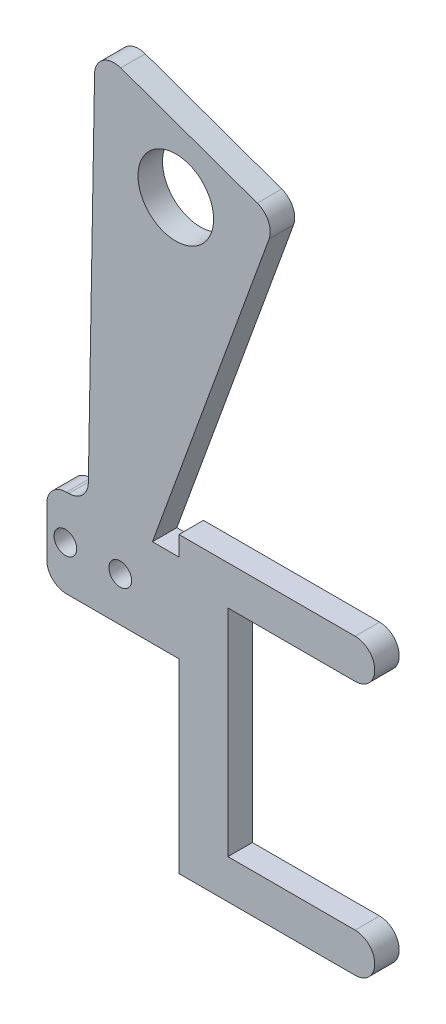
ISO-10303-21;
HEADER;
FILE_DESCRIPTION(('STEP AP214'),'2;1');
FILE_NAME('part.step','',(''),(''),'','','');
FILE_SCHEMA(('AUTOMOTIVE_DESIGN { 1 0 10303 214 1 1 1 1 }'));
ENDSEC;
DATA;
#1=APPLICATION_CONTEXT('core data for automotive mechanical design processes');
#2=APPLICATION_PROTOCOL_DEFINITION('international standard','automotive_design',2000,#1);
#3=PRODUCT_CONTEXT('',#1,'mechanical');
#4=PRODUCT('Part','Part','',(#3));
#5=PRODUCT_RELATED_PRODUCT_CATEGORY('part','',(#4));
#6=PRODUCT_DEFINITION_FORMATION('','',#4);
#7=PRODUCT_DEFINITION_CONTEXT('part definition',#1,'design');
#8=PRODUCT_DEFINITION('design','',#6,#7);
#9=PRODUCT_DEFINITION_SHAPE('','',#8);
#10=(LENGTH_UNIT() NAMED_UNIT(*) SI_UNIT(.MILLI.,.METRE.));
#11=(NAMED_UNIT(*) PLANE_ANGLE_UNIT() SI_UNIT($,.RADIAN.));
#12=(NAMED_UNIT(*) SI_UNIT($,.STERADIAN.) SOLID_ANGLE_UNIT());
#13=UNCERTAINTY_MEASURE_WITH_UNIT(LENGTH_MEASURE(1.E-05),#10,'distance_accuracy_value','');
#14=(GEOMETRIC_REPRESENTATION_CONTEXT(3) GLOBAL_UNCERTAINTY_ASSIGNED_CONTEXT((#13)) GLOBAL_UNIT_ASSIGNED_CONTEXT((#10,
#11,#12)) REPRESENTATION_CONTEXT('',''));
#15=CARTESIAN_POINT('',(0.,0.,0.));
#16=DIRECTION('',(0.,0.,1.));
#17=DIRECTION('',(1.,0.,0.));
#18=AXIS2_PLACEMENT_3D('',#15,#16,#17);
#19=CARTESIAN_POINT('',(0.,11.43,3.175));
#20=DIRECTION('',(0.,-1.,0.));
#21=DIRECTION('',(0.,0.,-1.));
#22=AXIS2_PLACEMENT_3D('',#19,#20,#21);
#23=PLANE('',#22);
#24=DIRECTION('',(-1.,0.,0.));
#25=VECTOR('',#24,1.);
#26=CARTESIAN_POINT('',(0.,11.43,3.175));
#27=LINE('',#26,#25);
#28=CARTESIAN_POINT('',(-0.323217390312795,11.43,3.175));
#29=VERTEX_POINT('',#28);
#30=CARTESIAN_POINT('',(-0.635000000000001,11.43,3.175));
#31=VERTEX_POINT('',#30);
#32=EDGE_CURVE('E189',#29,#31,#27,.T.);
#33=ORIENTED_EDGE('',*,*,#32,.F.);
#34=DIRECTION('',(0.,0.,-1.));
#35=VECTOR('',#34,1.);
#36=CARTESIAN_POINT('',(-0.323217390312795,11.43,0.));
#37=LINE('',#36,#35);
#38=CARTESIAN_POINT('',(-0.323217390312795,11.43,0.));
#39=VERTEX_POINT('',#38);
#40=EDGE_CURVE('E249',#29,#39,#37,.T.);
#41=ORIENTED_EDGE('',*,*,#40,.T.);
#42=DIRECTION('',(-1.,0.,0.));
#43=VECTOR('',#42,1.);
#44=CARTESIAN_POINT('',(0.,11.43,0.));
#45=LINE('',#44,#43);
#46=CARTESIAN_POINT('',(-0.635000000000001,11.43,0.));
#47=VERTEX_POINT('',#46);
#48=EDGE_CURVE('E255',#39,#47,#45,.T.);
#49=ORIENTED_EDGE('',*,*,#48,.T.);
#50=DIRECTION('',(0.,0.,-1.));
#51=VECTOR('',#50,1.);
#52=CARTESIAN_POINT('',(-0.635000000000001,11.43,3.175));
#53=LINE('',#52,#51);
#54=EDGE_CURVE('E225',#47,#31,#53,.F.);
#55=ORIENTED_EDGE('',*,*,#54,.T.);
#56=EDGE_LOOP('',(#33,#41,#49,#55));
#57=FACE_BOUND('',#56,.T.);
#58=ADVANCED_FACE('F34',(#57),#23,.F.);
#59=DIRECTION('',(0.,0.,-1.));
#60=VECTOR('',#59,1.);
#61=CARTESIAN_POINT('',(10.5271663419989,11.43,3.175));
#62=LINE('',#61,#60);
#63=CARTESIAN_POINT('',(10.5271663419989,11.43,3.175));
#64=VERTEX_POINT('',#63);
#65=CARTESIAN_POINT('',(10.5271663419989,11.43,0.));
#66=VERTEX_POINT('',#65);
#67=EDGE_CURVE('E184',#64,#66,#62,.T.);
#68=ORIENTED_EDGE('',*,*,#67,.F.);
#69=CARTESIAN_POINT('',(13.97,11.43,3.175));
#70=VERTEX_POINT('',#69);
#71=EDGE_CURVE('E177',#70,#64,#27,.T.);
#72=ORIENTED_EDGE('',*,*,#71,.F.);
#73=DIRECTION('',(0.,0.,-1.));
#74=VECTOR('',#73,1.);
#75=CARTESIAN_POINT('',(13.97,11.43,3.175));
#76=LINE('',#75,#74);
#77=CARTESIAN_POINT('',(13.97,11.43,0.));
#78=VERTEX_POINT('',#77);
#79=EDGE_CURVE('E181',#70,#78,#76,.T.);
#80=ORIENTED_EDGE('',*,*,#79,.T.);
#81=EDGE_CURVE('E261',#78,#66,#45,.T.);
#82=ORIENTED_EDGE('',*,*,#81,.T.);
#83=EDGE_LOOP('',(#68,#72,#80,#82));
#84=FACE_BOUND('',#83,.T.);
#85=ADVANCED_FACE('F179',(#84),#23,.F.);
#86=CARTESIAN_POINT('',(13.97,11.43,3.175));
#87=DIRECTION('',(1.,0.,0.));
#88=DIRECTION('',(0.,0.,-1.));
#89=AXIS2_PLACEMENT_3D('',#86,#87,#88);
#90=PLANE('',#89);
#91=DIRECTION('',(0.,-1.,0.));
#92=VECTOR('',#91,1.);
#93=CARTESIAN_POINT('',(13.97,11.43,0.));
#94=LINE('',#93,#92);
#95=CARTESIAN_POINT('',(13.97,13.97,0.));
#96=VERTEX_POINT('',#95);
#97=EDGE_CURVE('E203',#96,#78,#94,.T.);
#98=ORIENTED_EDGE('',*,*,#97,.T.);
#99=ORIENTED_EDGE('',*,*,#79,.F.);
#100=DIRECTION('',(0.,-1.,0.));
#101=VECTOR('',#100,1.);
#102=CARTESIAN_POINT('',(13.97,11.43,3.175));
#103=LINE('',#102,#101);
#104=CARTESIAN_POINT('',(13.97,13.97,3.175));
#105=VERTEX_POINT('',#104);
#106=EDGE_CURVE('E192',#105,#70,#103,.T.);
#107=ORIENTED_EDGE('',*,*,#106,.F.);
#108=DIRECTION('',(0.,0.,-1.));
#109=VECTOR('',#108,1.);
#110=CARTESIAN_POINT('',(13.97,13.97,3.175));
#111=LINE('',#110,#109);
#112=EDGE_CURVE('E283',#105,#96,#111,.T.);
#113=ORIENTED_EDGE('',*,*,#112,.T.);
#114=EDGE_LOOP('',(#98,#99,#107,#113));
#115=FACE_BOUND('',#114,.T.);
#116=ADVANCED_FACE('F201',(#115),#90,.F.);
#117=CARTESIAN_POINT('',(13.97,0.,3.175));
#118=DIRECTION('',(0.,1.,0.));
#119=DIRECTION('',(-1.,0.,0.));
#120=AXIS2_PLACEMENT_3D('',#117,#118,#119);
#121=PLANE('',#120);
#122=DIRECTION('',(1.,0.,0.));
#123=VECTOR('',#122,1.);
#124=CARTESIAN_POINT('',(13.97,0.,3.175));
#125=LINE('',#124,#123);
#126=CARTESIAN_POINT('',(-0.635,0.,3.175));
#127=VERTEX_POINT('',#126);
#128=CARTESIAN_POINT('',(13.97,0.,3.175));
#129=VERTEX_POINT('',#128);
#130=EDGE_CURVE('E188',#127,#129,#125,.T.);
#131=ORIENTED_EDGE('',*,*,#130,.F.);
#132=DIRECTION('',(0.,0.,-1.));
#133=VECTOR('',#132,1.);
#134=CARTESIAN_POINT('',(-0.635,0.,3.175));
#135=LINE('',#134,#133);
#136=CARTESIAN_POINT('',(-0.635,0.,0.));
#137=VERTEX_POINT('',#136);
#138=EDGE_CURVE('E246',#127,#137,#135,.T.);
#139=ORIENTED_EDGE('',*,*,#138,.T.);
#140=DIRECTION('',(1.,0.,0.));
#141=VECTOR('',#140,1.);
#142=CARTESIAN_POINT('',(13.97,0.,0.));
#143=LINE('',#142,#141);
#144=CARTESIAN_POINT('',(13.97,0.,0.));
#145=VERTEX_POINT('',#144);
#146=EDGE_CURVE('E263',#137,#145,#143,.T.);
#147=ORIENTED_EDGE('',*,*,#146,.T.);
#148=DIRECTION('',(0.,0.,-1.));
#149=VECTOR('',#148,1.);
#150=CARTESIAN_POINT('',(13.97,0.,3.175));
#151=LINE('',#150,#149);
#152=EDGE_CURVE('E205',#129,#145,#151,.T.);
#153=ORIENTED_EDGE('',*,*,#152,.F.);
#154=EDGE_LOOP('',(#131,#139,#147,#153));
#155=FACE_BOUND('',#154,.T.);
#156=ADVANCED_FACE('F368',(#155),#121,.F.);
#157=CARTESIAN_POINT('',(13.97,-24.13,3.175));
#158=DIRECTION('',(1.,0.,0.));
#159=DIRECTION('',(0.,0.,-1.));
#160=AXIS2_PLACEMENT_3D('',#157,#158,#159);
#161=PLANE('',#160);
#162=DIRECTION('',(0.,-1.,0.));
#163=VECTOR('',#162,1.);
#164=CARTESIAN_POINT('',(13.97,-24.13,0.));
#165=LINE('',#164,#163);
#166=CARTESIAN_POINT('',(13.97,-24.13,0.));
#167=VERTEX_POINT('',#166);
#168=EDGE_CURVE('E268',#145,#167,#165,.T.);
#169=ORIENTED_EDGE('',*,*,#168,.T.);
#170=DIRECTION('',(0.,0.,-1.));
#171=VECTOR('',#170,1.);
#172=CARTESIAN_POINT('',(13.97,-24.13,3.175));
#173=LINE('',#172,#171);
#174=CARTESIAN_POINT('',(13.97,-24.13,3.175));
#175=VERTEX_POINT('',#174);
#176=EDGE_CURVE('E210',#175,#167,#173,.T.);
#177=ORIENTED_EDGE('',*,*,#176,.F.);
#178=DIRECTION('',(0.,-1.,0.));
#179=VECTOR('',#178,1.);
#180=CARTESIAN_POINT('',(13.97,-24.13,3.175));
#181=LINE('',#180,#179);
#182=EDGE_CURVE('E363',#129,#175,#181,.T.);
#183=ORIENTED_EDGE('',*,*,#182,.F.);
#184=ORIENTED_EDGE('',*,*,#152,.T.);
#185=EDGE_LOOP('',(#169,#177,#183,#184));
#186=FACE_BOUND('',#185,.T.);
#187=ADVANCED_FACE('F366',(#186),#161,.F.);
#188=CARTESIAN_POINT('',(13.97,-24.13,3.175));
#189=DIRECTION('',(0.,1.,0.));
#190=DIRECTION('',(0.,0.,1.));
#191=AXIS2_PLACEMENT_3D('',#188,#189,#190);
#192=PLANE('',#191);
#193=DIRECTION('',(1.,0.,0.));
#194=VECTOR('',#193,1.);
#195=CARTESIAN_POINT('',(13.97,-24.13,0.));
#196=LINE('',#195,#194);
#197=CARTESIAN_POINT('',(36.83,-24.13,0.));
#198=VERTEX_POINT('',#197);
#199=EDGE_CURVE('E270',#167,#198,#196,.T.);
#200=ORIENTED_EDGE('',*,*,#199,.T.);
#201=DIRECTION('',(0.,0.,-1.));
#202=VECTOR('',#201,1.);
#203=CARTESIAN_POINT('',(36.83,-24.13,3.175));
#204=LINE('',#203,#202);
#205=CARTESIAN_POINT('',(36.83,-24.13,3.175));
#206=VERTEX_POINT('',#205);
#207=EDGE_CURVE('E300',#206,#198,#204,.T.);
#208=ORIENTED_EDGE('',*,*,#207,.F.);
#209=DIRECTION('',(1.,0.,0.));
#210=VECTOR('',#209,1.);
#211=CARTESIAN_POINT('',(13.97,-24.13,3.175));
#212=LINE('',#211,#210);
#213=EDGE_CURVE('E309',#175,#206,#212,.T.);
#214=ORIENTED_EDGE('',*,*,#213,.F.);
#215=ORIENTED_EDGE('',*,*,#176,.T.);
#216=EDGE_LOOP('',(#200,#208,#214,#215));
#217=FACE_BOUND('',#216,.T.);
#218=ADVANCED_FACE('F307',(#217),#192,.F.);
#219=CARTESIAN_POINT('',(36.83,-21.59,3.175));
#220=DIRECTION('',(0.,0.,-1.));
#221=DIRECTION('',(-1.,0.,0.));
#222=AXIS2_PLACEMENT_3D('',#219,#220,#221);
#223=CYLINDRICAL_SURFACE('',#222,2.54);
#224=CARTESIAN_POINT('',(36.83,-21.59,0.));
#225=DIRECTION('',(0.,0.,1.));
#226=DIRECTION('',(-1.,0.,0.));
#227=AXIS2_PLACEMENT_3D('',#224,#225,#226);
#228=CIRCLE('',#227,2.54);
#229=CARTESIAN_POINT('',(36.83,-19.05,0.));
#230=VERTEX_POINT('',#229);
#231=EDGE_CURVE('E272',#198,#230,#228,.T.);
#232=ORIENTED_EDGE('',*,*,#231,.T.);
#233=DIRECTION('',(0.,0.,-1.));
#234=VECTOR('',#233,1.);
#235=CARTESIAN_POINT('',(36.83,-19.05,3.175));
#236=LINE('',#235,#234);
#237=CARTESIAN_POINT('',(36.83,-19.05,3.175));
#238=VERTEX_POINT('',#237);
#239=EDGE_CURVE('E297',#238,#230,#236,.T.);
#240=ORIENTED_EDGE('',*,*,#239,.F.);
#241=CARTESIAN_POINT('',(36.83,-21.59,3.175));
#242=DIRECTION('',(0.,0.,1.));
#243=DIRECTION('',(-1.,0.,0.));
#244=AXIS2_PLACEMENT_3D('',#241,#242,#243);
#245=CIRCLE('',#244,2.54);
#246=EDGE_CURVE('E328',#206,#238,#245,.T.);
#247=ORIENTED_EDGE('',*,*,#246,.F.);
#248=ORIENTED_EDGE('',*,*,#207,.T.);
#249=EDGE_LOOP('',(#232,#240,#247,#248));
#250=FACE_BOUND('',#249,.T.);
#251=ADVANCED_FACE('F319',(#250),#223,.T.);
#252=CARTESIAN_POINT('',(20.32,-19.05,3.175));
#253=DIRECTION('',(0.,-1.,0.));
#254=DIRECTION('',(0.,0.,-1.));
#255=AXIS2_PLACEMENT_3D('',#252,#253,#254);
#256=PLANE('',#255);
#257=DIRECTION('',(-1.,0.,0.));
#258=VECTOR('',#257,1.);
#259=CARTESIAN_POINT('',(20.32,-19.05,0.));
#260=LINE('',#259,#258);
#261=CARTESIAN_POINT('',(20.32,-19.05,0.));
#262=VERTEX_POINT('',#261);
#263=EDGE_CURVE('E274',#230,#262,#260,.T.);
#264=ORIENTED_EDGE('',*,*,#263,.T.);
#265=DIRECTION('',(0.,0.,-1.));
#266=VECTOR('',#265,1.);
#267=CARTESIAN_POINT('',(20.32,-19.05,3.175));
#268=LINE('',#267,#266);
#269=CARTESIAN_POINT('',(20.32,-19.05,3.175));
#270=VERTEX_POINT('',#269);
#271=EDGE_CURVE('E294',#270,#262,#268,.T.);
#272=ORIENTED_EDGE('',*,*,#271,.F.);
#273=DIRECTION('',(-1.,0.,0.));
#274=VECTOR('',#273,1.);
#275=CARTESIAN_POINT('',(20.32,-19.05,3.175));
#276=LINE('',#275,#274);
#277=EDGE_CURVE('E325',#238,#270,#276,.T.);
#278=ORIENTED_EDGE('',*,*,#277,.F.);
#279=ORIENTED_EDGE('',*,*,#239,.T.);
#280=EDGE_LOOP('',(#264,#272,#278,#279));
#281=FACE_BOUND('',#280,.T.);
#282=ADVANCED_FACE('F323',(#281),#256,.F.);
#283=CARTESIAN_POINT('',(20.32,8.89,3.175));
#284=DIRECTION('',(-1.,0.,0.));
#285=DIRECTION('',(0.,-1.,0.));
#286=AXIS2_PLACEMENT_3D('',#283,#284,#285);
#287=PLANE('',#286);
#288=DIRECTION('',(0.,1.,0.));
#289=VECTOR('',#288,1.);
#290=CARTESIAN_POINT('',(20.32,8.89,0.));
#291=LINE('',#290,#289);
#292=CARTESIAN_POINT('',(20.32,8.89,0.));
#293=VERTEX_POINT('',#292);
#294=EDGE_CURVE('E276',#262,#293,#291,.T.);
#295=ORIENTED_EDGE('',*,*,#294,.T.);
#296=DIRECTION('',(0.,0.,-1.));
#297=VECTOR('',#296,1.);
#298=CARTESIAN_POINT('',(20.32,8.89,3.175));
#299=LINE('',#298,#297);
#300=CARTESIAN_POINT('',(20.32,8.89,3.175));
#301=VERTEX_POINT('',#300);
#302=EDGE_CURVE('E291',#301,#293,#299,.T.);
#303=ORIENTED_EDGE('',*,*,#302,.F.);
#304=DIRECTION('',(0.,1.,0.));
#305=VECTOR('',#304,1.);
#306=CARTESIAN_POINT('',(20.32,8.89,3.175));
#307=LINE('',#306,#305);
#308=EDGE_CURVE('E327',#270,#301,#307,.T.);
#309=ORIENTED_EDGE('',*,*,#308,.F.);
#310=ORIENTED_EDGE('',*,*,#271,.T.);
#311=EDGE_LOOP('',(#295,#303,#309,#310));
#312=FACE_BOUND('',#311,.T.);
#313=ADVANCED_FACE('F444',(#312),#287,.F.);
#314=CARTESIAN_POINT('',(20.32,8.89,3.175));
#315=DIRECTION('',(0.,1.,0.));
#316=DIRECTION('',(0.,0.,1.));
#317=AXIS2_PLACEMENT_3D('',#314,#315,#316);
#318=PLANE('',#317);
#319=DIRECTION('',(1.,0.,0.));
#320=VECTOR('',#319,1.);
#321=CARTESIAN_POINT('',(20.32,8.89,0.));
#322=LINE('',#321,#320);
#323=CARTESIAN_POINT('',(36.83,8.89,0.));
#324=VERTEX_POINT('',#323);
#325=EDGE_CURVE('E278',#293,#324,#322,.T.);
#326=ORIENTED_EDGE('',*,*,#325,.T.);
#327=DIRECTION('',(0.,0.,-1.));
#328=VECTOR('',#327,1.);
#329=CARTESIAN_POINT('',(36.83,8.89,3.175));
#330=LINE('',#329,#328);
#331=CARTESIAN_POINT('',(36.83,8.89,3.175));
#332=VERTEX_POINT('',#331);
#333=EDGE_CURVE('E288',#332,#324,#330,.T.);
#334=ORIENTED_EDGE('',*,*,#333,.F.);
#335=DIRECTION('',(1.,0.,0.));
#336=VECTOR('',#335,1.);
#337=CARTESIAN_POINT('',(20.32,8.89,3.175));
#338=LINE('',#337,#336);
#339=EDGE_CURVE('E330',#301,#332,#338,.T.);
#340=ORIENTED_EDGE('',*,*,#339,.F.);
#341=ORIENTED_EDGE('',*,*,#302,.T.);
#342=EDGE_LOOP('',(#326,#334,#340,#341));
#343=FACE_BOUND('',#342,.T.);
#344=ADVANCED_FACE('F447',(#343),#318,.F.);
#345=CARTESIAN_POINT('',(36.83,11.43,3.175));
#346=DIRECTION('',(0.,0.,-1.));
#347=DIRECTION('',(-1.,0.,0.));
#348=AXIS2_PLACEMENT_3D('',#345,#346,#347);
#349=CYLINDRICAL_SURFACE('',#348,2.54);
#350=CARTESIAN_POINT('',(36.83,11.43,0.));
#351=DIRECTION('',(0.,0.,1.));
#352=DIRECTION('',(1.,0.,0.));
#353=AXIS2_PLACEMENT_3D('',#350,#351,#352);
#354=CIRCLE('',#353,2.54);
#355=CARTESIAN_POINT('',(36.83,13.97,0.));
#356=VERTEX_POINT('',#355);
#357=EDGE_CURVE('E280',#324,#356,#354,.T.);
#358=ORIENTED_EDGE('',*,*,#357,.T.);
#359=DIRECTION('',(0.,0.,-1.));
#360=VECTOR('',#359,1.);
#361=CARTESIAN_POINT('',(36.83,13.97,3.175));
#362=LINE('',#361,#360);
#363=CARTESIAN_POINT('',(36.83,13.97,3.175));
#364=VERTEX_POINT('',#363);
#365=EDGE_CURVE('E285',#364,#356,#362,.T.);
#366=ORIENTED_EDGE('',*,*,#365,.F.);
#367=CARTESIAN_POINT('',(36.83,11.43,3.175));
#368=DIRECTION('',(0.,0.,1.));
#369=DIRECTION('',(1.,0.,0.));
#370=AXIS2_PLACEMENT_3D('',#367,#368,#369);
#371=CIRCLE('',#370,2.54);
#372=EDGE_CURVE('E336',#332,#364,#371,.T.);
#373=ORIENTED_EDGE('',*,*,#372,.F.);
#374=ORIENTED_EDGE('',*,*,#333,.T.);
#375=EDGE_LOOP('',(#358,#366,#373,#374));
#376=FACE_BOUND('',#375,.T.);
#377=ADVANCED_FACE('F342',(#376),#349,.T.);
#378=CARTESIAN_POINT('',(36.83,13.97,3.175));
#379=DIRECTION('',(0.,-1.,0.));
#380=DIRECTION('',(1.,0.,0.));
#381=AXIS2_PLACEMENT_3D('',#378,#379,#380);
#382=PLANE('',#381);
#383=DIRECTION('',(-1.,0.,0.));
#384=VECTOR('',#383,1.);
#385=CARTESIAN_POINT('',(36.83,13.97,0.));
#386=LINE('',#385,#384);
#387=EDGE_CURVE('E199',#356,#96,#386,.T.);
#388=ORIENTED_EDGE('',*,*,#387,.T.);
#389=ORIENTED_EDGE('',*,*,#112,.F.);
#390=DIRECTION('',(-1.,0.,0.));
#391=VECTOR('',#390,1.);
#392=CARTESIAN_POINT('',(36.83,13.97,3.175));
#393=LINE('',#392,#391);
#394=EDGE_CURVE('E195',#364,#105,#393,.T.);
#395=ORIENTED_EDGE('',*,*,#394,.F.);
#396=ORIENTED_EDGE('',*,*,#365,.T.);
#397=EDGE_LOOP('',(#388,#389,#395,#396));
#398=FACE_BOUND('',#397,.T.);
#399=ADVANCED_FACE('F346',(#398),#382,.F.);
#400=CARTESIAN_POINT('',(36.83,11.43,3.175));
#401=DIRECTION('',(0.,0.,1.));
#402=DIRECTION('',(1.,0.,0.));
#403=AXIS2_PLACEMENT_3D('',#400,#401,#402);
#404=PLANE('',#403);
#405=CARTESIAN_POINT('',(13.5585725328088,51.6272762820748,3.175));
#406=DIRECTION('',(0.,0.,1.));
#407=DIRECTION('',(1.,0.,0.));
#408=AXIS2_PLACEMENT_3D('',#405,#406,#407);
#409=CIRCLE('',#408,4.90219999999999);
#410=CARTESIAN_POINT('',(18.4607725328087,51.6272762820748,3.175));
#411=VERTEX_POINT('',#410);
#412=EDGE_CURVE('E491',#411,#411,#409,.T.);
#413=ORIENTED_EDGE('',*,*,#412,.F.);
#414=EDGE_LOOP('',(#413));
#415=FACE_BOUND('',#414,.T.);
#416=CARTESIAN_POINT('',(-0.762000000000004,5.715,3.175));
#417=DIRECTION('',(0.,0.,1.));
#418=DIRECTION('',(1.,0.,0.));
#419=AXIS2_PLACEMENT_3D('',#416,#417,#418);
#420=CIRCLE('',#419,1.47319999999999);
#421=CARTESIAN_POINT('',(0.711199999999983,5.715,3.175));
#422=VERTEX_POINT('',#421);
#423=EDGE_CURVE('E484',#422,#422,#420,.T.);
#424=ORIENTED_EDGE('',*,*,#423,.F.);
#425=EDGE_LOOP('',(#424));
#426=FACE_BOUND('',#425,.T.);
#427=CARTESIAN_POINT('',(6.35,5.715,3.175));
#428=DIRECTION('',(0.,0.,1.));
#429=DIRECTION('',(1.,0.,0.));
#430=AXIS2_PLACEMENT_3D('',#427,#428,#429);
#431=CIRCLE('',#430,1.47319999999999);
#432=CARTESIAN_POINT('',(7.82319999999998,5.715,3.175));
#433=VERTEX_POINT('',#432);
#434=EDGE_CURVE('E488',#433,#433,#431,.T.);
#435=ORIENTED_EDGE('',*,*,#434,.F.);
#436=EDGE_LOOP('',(#435));
#437=FACE_BOUND('',#436,.T.);
#438=DIRECTION('',(-0.0174524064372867,-0.999847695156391,0.));
#439=VECTOR('',#438,1.);
#440=CARTESIAN_POINT('',(2.17283365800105,11.43,3.175));
#441=LINE('',#440,#439);
#442=CARTESIAN_POINT('',(3.02521909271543,60.2631288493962,3.175));
#443=VERTEX_POINT('',#442);
#444=CARTESIAN_POINT('',(2.21639575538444,13.9256708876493,3.175));
#445=VERTEX_POINT('',#444);
#446=EDGE_CURVE('E391',#443,#445,#441,.T.);
#447=ORIENTED_EDGE('',*,*,#446,.T.);
#448=CARTESIAN_POINT('',(-0.323217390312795,13.97,3.175));
#449=DIRECTION('',(0.,0.,1.));
#450=DIRECTION('',(1.,0.,0.));
#451=AXIS2_PLACEMENT_3D('',#448,#449,#450);
#452=CIRCLE('',#451,2.54);
#453=EDGE_CURVE('E11',#445,#29,#452,.F.);
#454=ORIENTED_EDGE('',*,*,#453,.T.);
#455=ORIENTED_EDGE('',*,*,#32,.T.);
#456=CARTESIAN_POINT('',(-0.635000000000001,8.89,3.175));
#457=DIRECTION('',(0.,0.,1.));
#458=DIRECTION('',(1.,0.,0.));
#459=AXIS2_PLACEMENT_3D('',#456,#457,#458);
#460=CIRCLE('',#459,2.54);
#461=CARTESIAN_POINT('',(-3.175,8.89,3.175));
#462=VERTEX_POINT('',#461);
#463=EDGE_CURVE('E234',#31,#462,#460,.T.);
#464=ORIENTED_EDGE('',*,*,#463,.T.);
#465=DIRECTION('',(0.,-1.,0.));
#466=VECTOR('',#465,1.);
#467=CARTESIAN_POINT('',(-3.175,11.43,3.175));
#468=LINE('',#467,#466);
#469=CARTESIAN_POINT('',(-3.175,2.54,3.175));
#470=VERTEX_POINT('',#469);
#471=EDGE_CURVE('E379',#462,#470,#468,.T.);
#472=ORIENTED_EDGE('',*,*,#471,.T.);
#473=CARTESIAN_POINT('',(-0.635,2.54,3.175));
#474=DIRECTION('',(0.,0.,1.));
#475=DIRECTION('',(1.,0.,0.));
#476=AXIS2_PLACEMENT_3D('',#473,#474,#475);
#477=CIRCLE('',#476,2.54);
#478=EDGE_CURVE('E228',#470,#127,#477,.T.);
#479=ORIENTED_EDGE('',*,*,#478,.T.);
#480=ORIENTED_EDGE('',*,*,#130,.T.);
#481=ORIENTED_EDGE('',*,*,#182,.T.);
#482=ORIENTED_EDGE('',*,*,#213,.T.);
#483=ORIENTED_EDGE('',*,*,#246,.T.);
#484=ORIENTED_EDGE('',*,*,#277,.T.);
#485=ORIENTED_EDGE('',*,*,#308,.T.);
#486=ORIENTED_EDGE('',*,*,#339,.T.);
#487=ORIENTED_EDGE('',*,*,#372,.T.);
#488=ORIENTED_EDGE('',*,*,#394,.T.);
#489=ORIENTED_EDGE('',*,*,#106,.T.);
#490=ORIENTED_EDGE('',*,*,#71,.T.);
#491=DIRECTION('',(0.342020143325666,0.93969262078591,0.));
#492=VECTOR('',#491,1.);
#493=CARTESIAN_POINT('',(10.5271663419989,11.43,3.175));
#494=LINE('',#493,#492);
#495=CARTESIAN_POINT('',(25.6629385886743,53.0151924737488,3.175));
#496=VERTEX_POINT('',#495);
#497=EDGE_CURVE('E353',#64,#496,#494,.T.);
#498=ORIENTED_EDGE('',*,*,#497,.T.);
#499=CARTESIAN_POINT('',(23.276119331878,53.883923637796,3.175));
#500=DIRECTION('',(0.,0.,1.));
#501=DIRECTION('',(1.,0.,0.));
#502=AXIS2_PLACEMENT_3D('',#499,#500,#501);
#503=CIRCLE('',#502,2.54);
#504=CARTESIAN_POINT('',(24.1315413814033,56.2755450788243,3.175));
#505=VERTEX_POINT('',#504);
#506=EDGE_CURVE('E232',#496,#505,#503,.T.);
#507=ORIENTED_EDGE('',*,*,#506,.T.);
#508=DIRECTION('',(-0.941583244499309,0.336780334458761,0.));
#509=VECTOR('',#508,1.);
#510=CARTESIAN_POINT('',(3.0870015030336,63.8026407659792,3.175));
#511=LINE('',#510,#509);
#512=CARTESIAN_POINT('',(6.42025428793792,62.6104211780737,3.175));
#513=VERTEX_POINT('',#512);
#514=EDGE_CURVE('E354',#505,#513,#511,.T.);
#515=ORIENTED_EDGE('',*,*,#514,.T.);
#516=CARTESIAN_POINT('',(5.56483223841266,60.2187997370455,3.175));
#517=DIRECTION('',(0.,0.,1.));
#518=DIRECTION('',(1.,0.,0.));
#519=AXIS2_PLACEMENT_3D('',#516,#517,#518);
#520=CIRCLE('',#519,2.54);
#521=EDGE_CURVE('E230',#513,#443,#520,.T.);
#522=ORIENTED_EDGE('',*,*,#521,.T.);
#523=EDGE_LOOP('',(#447,#454,#455,#464,#472,#479,#480,#481,#482,#483,#484,#485,#486,#487,#488,
#489,#490,#498,#507,#515,#522));
#524=FACE_BOUND('',#523,.T.);
#525=ADVANCED_FACE('F193',(#415,#426,#437,#524),#404,.T.);
#526=CARTESIAN_POINT('',(36.83,11.43,0.));
#527=DIRECTION('',(0.,0.,1.));
#528=DIRECTION('',(1.,0.,0.));
#529=AXIS2_PLACEMENT_3D('',#526,#527,#528);
#530=PLANE('',#529);
#531=CARTESIAN_POINT('',(13.5585725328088,51.6272762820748,0.));
#532=DIRECTION('',(0.,0.,1.));
#533=DIRECTION('',(1.,0.,0.));
#534=AXIS2_PLACEMENT_3D('',#531,#532,#533);
#535=CIRCLE('',#534,4.9022);
#536=CARTESIAN_POINT('',(18.4607725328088,51.6272762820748,0.));
#537=VERTEX_POINT('',#536);
#538=EDGE_CURVE('E486',#537,#537,#535,.T.);
#539=ORIENTED_EDGE('',*,*,#538,.T.);
#540=EDGE_LOOP('',(#539));
#541=FACE_BOUND('',#540,.T.);
#542=CARTESIAN_POINT('',(-0.762000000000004,5.715,0.));
#543=DIRECTION('',(0.,0.,1.));
#544=DIRECTION('',(1.,0.,0.));
#545=AXIS2_PLACEMENT_3D('',#542,#543,#544);
#546=CIRCLE('',#545,1.4732);
#547=CARTESIAN_POINT('',(0.711199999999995,5.715,0.));
#548=VERTEX_POINT('',#547);
#549=EDGE_CURVE('E481',#548,#548,#546,.T.);
#550=ORIENTED_EDGE('',*,*,#549,.T.);
#551=EDGE_LOOP('',(#550));
#552=FACE_BOUND('',#551,.T.);
#553=CARTESIAN_POINT('',(6.35,5.715,0.));
#554=DIRECTION('',(0.,0.,1.));
#555=DIRECTION('',(1.,0.,0.));
#556=AXIS2_PLACEMENT_3D('',#553,#554,#555);
#557=CIRCLE('',#556,1.4732);
#558=CARTESIAN_POINT('',(7.8232,5.715,0.));
#559=VERTEX_POINT('',#558);
#560=EDGE_CURVE('E380',#559,#559,#557,.T.);
#561=ORIENTED_EDGE('',*,*,#560,.T.);
#562=EDGE_LOOP('',(#561));
#563=FACE_BOUND('',#562,.T.);
#564=DIRECTION('',(0.,-1.,0.));
#565=VECTOR('',#564,1.);
#566=CARTESIAN_POINT('',(-3.175,11.43,0.));
#567=LINE('',#566,#565);
#568=CARTESIAN_POINT('',(-3.175,8.89,0.));
#569=VERTEX_POINT('',#568);
#570=CARTESIAN_POINT('',(-3.175,2.54,0.));
#571=VERTEX_POINT('',#570);
#572=EDGE_CURVE('E371',#569,#571,#567,.T.);
#573=ORIENTED_EDGE('',*,*,#572,.F.);
#574=CARTESIAN_POINT('',(-0.635000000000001,8.89,0.));
#575=DIRECTION('',(0.,0.,1.));
#576=DIRECTION('',(1.,0.,0.));
#577=AXIS2_PLACEMENT_3D('',#574,#575,#576);
#578=CIRCLE('',#577,2.54);
#579=EDGE_CURVE('E222',#569,#47,#578,.F.);
#580=ORIENTED_EDGE('',*,*,#579,.T.);
#581=ORIENTED_EDGE('',*,*,#48,.F.);
#582=CARTESIAN_POINT('',(-0.323217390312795,13.97,0.));
#583=DIRECTION('',(0.,0.,1.));
#584=DIRECTION('',(1.,0.,0.));
#585=AXIS2_PLACEMENT_3D('',#582,#583,#584);
#586=CIRCLE('',#585,2.54);
#587=CARTESIAN_POINT('',(2.21639575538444,13.9256708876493,0.));
#588=VERTEX_POINT('',#587);
#589=EDGE_CURVE('E42',#39,#588,#586,.T.);
#590=ORIENTED_EDGE('',*,*,#589,.T.);
#591=DIRECTION('',(-0.0174524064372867,-0.999847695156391,0.));
#592=VECTOR('',#591,1.);
#593=CARTESIAN_POINT('',(2.17283365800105,11.43,0.));
#594=LINE('',#593,#592);
#595=CARTESIAN_POINT('',(3.02521909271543,60.2631288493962,0.));
#596=VERTEX_POINT('',#595);
#597=EDGE_CURVE('E385',#596,#588,#594,.T.);
#598=ORIENTED_EDGE('',*,*,#597,.F.);
#599=CARTESIAN_POINT('',(5.56483223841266,60.2187997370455,0.));
#600=DIRECTION('',(0.,0.,1.));
#601=DIRECTION('',(1.,0.,0.));
#602=AXIS2_PLACEMENT_3D('',#599,#600,#601);
#603=CIRCLE('',#602,2.54);
#604=CARTESIAN_POINT('',(6.42025428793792,62.6104211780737,0.));
#605=VERTEX_POINT('',#604);
#606=EDGE_CURVE('E218',#596,#605,#603,.F.);
#607=ORIENTED_EDGE('',*,*,#606,.T.);
#608=DIRECTION('',(-0.941583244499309,0.336780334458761,0.));
#609=VECTOR('',#608,1.);
#610=CARTESIAN_POINT('',(3.0870015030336,63.8026407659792,0.));
#611=LINE('',#610,#609);
#612=CARTESIAN_POINT('',(24.1315413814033,56.2755450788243,0.));
#613=VERTEX_POINT('',#612);
#614=EDGE_CURVE('E359',#613,#605,#611,.T.);
#615=ORIENTED_EDGE('',*,*,#614,.F.);
#616=CARTESIAN_POINT('',(23.276119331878,53.883923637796,0.));
#617=DIRECTION('',(0.,0.,1.));
#618=DIRECTION('',(1.,0.,0.));
#619=AXIS2_PLACEMENT_3D('',#616,#617,#618);
#620=CIRCLE('',#619,2.54);
#621=CARTESIAN_POINT('',(25.6629385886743,53.0151924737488,0.));
#622=VERTEX_POINT('',#621);
#623=EDGE_CURVE('E220',#613,#622,#620,.F.);
#624=ORIENTED_EDGE('',*,*,#623,.T.);
#625=DIRECTION('',(0.342020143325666,0.93969262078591,0.));
#626=VECTOR('',#625,1.);
#627=CARTESIAN_POINT('',(10.5271663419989,11.43,0.));
#628=LINE('',#627,#626);
#629=EDGE_CURVE('E349',#66,#622,#628,.T.);
#630=ORIENTED_EDGE('',*,*,#629,.F.);
#631=ORIENTED_EDGE('',*,*,#81,.F.);
#632=ORIENTED_EDGE('',*,*,#97,.F.);
#633=ORIENTED_EDGE('',*,*,#387,.F.);
#634=ORIENTED_EDGE('',*,*,#357,.F.);
#635=ORIENTED_EDGE('',*,*,#325,.F.);
#636=ORIENTED_EDGE('',*,*,#294,.F.);
#637=ORIENTED_EDGE('',*,*,#263,.F.);
#638=ORIENTED_EDGE('',*,*,#231,.F.);
#639=ORIENTED_EDGE('',*,*,#199,.F.);
#640=ORIENTED_EDGE('',*,*,#168,.F.);
#641=ORIENTED_EDGE('',*,*,#146,.F.);
#642=CARTESIAN_POINT('',(-0.635,2.54,0.));
#643=DIRECTION('',(0.,0.,1.));
#644=DIRECTION('',(1.,0.,0.));
#645=AXIS2_PLACEMENT_3D('',#642,#643,#644);
#646=CIRCLE('',#645,2.54);
#647=EDGE_CURVE('E216',#137,#571,#646,.F.);
#648=ORIENTED_EDGE('',*,*,#647,.T.);
#649=EDGE_LOOP('',(#573,#580,#581,#590,#598,#607,#615,#624,#630,#631,#632,#633,#634,#635,#636,
#637,#638,#639,#640,#641,#648));
#650=FACE_BOUND('',#649,.T.);
#651=ADVANCED_FACE('F259',(#541,#552,#563,#650),#530,.F.);
#652=CARTESIAN_POINT('',(2.17283365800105,11.43,3.175));
#653=DIRECTION('',(0.999847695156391,-0.0174524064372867,0.));
#654=DIRECTION('',(0.0174524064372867,0.999847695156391,0.));
#655=AXIS2_PLACEMENT_3D('',#652,#653,#654);
#656=PLANE('',#655);
#657=ORIENTED_EDGE('',*,*,#597,.T.);
#658=DIRECTION('',(0.,0.,-1.));
#659=VECTOR('',#658,1.);
#660=CARTESIAN_POINT('',(2.21639575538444,13.9256708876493,3.175));
#661=LINE('',#660,#659);
#662=EDGE_CURVE('E55',#588,#445,#661,.F.);
#663=ORIENTED_EDGE('',*,*,#662,.T.);
#664=ORIENTED_EDGE('',*,*,#446,.F.);
#665=DIRECTION('',(0.,0.,-1.));
#666=VECTOR('',#665,1.);
#667=CARTESIAN_POINT('',(3.02521909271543,60.2631288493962,3.175));
#668=LINE('',#667,#666);
#669=EDGE_CURVE('E243',#443,#596,#668,.T.);
#670=ORIENTED_EDGE('',*,*,#669,.T.);
#671=EDGE_LOOP('',(#657,#663,#664,#670));
#672=FACE_BOUND('',#671,.T.);
#673=ADVANCED_FACE('F404',(#672),#656,.F.);
#674=CARTESIAN_POINT('',(10.5271663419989,11.43,3.175));
#675=DIRECTION('',(-0.93969262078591,0.342020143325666,0.));
#676=DIRECTION('',(-0.342020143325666,-0.93969262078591,0.));
#677=AXIS2_PLACEMENT_3D('',#674,#675,#676);
#678=PLANE('',#677);
#679=ORIENTED_EDGE('',*,*,#629,.T.);
#680=DIRECTION('',(0.,0.,-1.));
#681=VECTOR('',#680,1.);
#682=CARTESIAN_POINT('',(25.6629385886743,53.0151924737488,3.175));
#683=LINE('',#682,#681);
#684=EDGE_CURVE('E241',#622,#496,#683,.F.);
#685=ORIENTED_EDGE('',*,*,#684,.T.);
#686=ORIENTED_EDGE('',*,*,#497,.F.);
#687=ORIENTED_EDGE('',*,*,#67,.T.);
#688=EDGE_LOOP('',(#679,#685,#686,#687));
#689=FACE_BOUND('',#688,.T.);
#690=ADVANCED_FACE('F351',(#689),#678,.F.);
#691=CARTESIAN_POINT('',(3.0870015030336,63.8026407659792,3.175));
#692=DIRECTION('',(-0.336780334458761,-0.941583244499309,0.));
#693=DIRECTION('',(0.941583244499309,-0.336780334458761,0.));
#694=AXIS2_PLACEMENT_3D('',#691,#692,#693);
#695=PLANE('',#694);
#696=ORIENTED_EDGE('',*,*,#514,.F.);
#697=DIRECTION('',(0.,0.,-1.));
#698=VECTOR('',#697,1.);
#699=CARTESIAN_POINT('',(24.1315413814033,56.2755450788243,3.175));
#700=LINE('',#699,#698);
#701=EDGE_CURVE('E238',#505,#613,#700,.T.);
#702=ORIENTED_EDGE('',*,*,#701,.T.);
#703=ORIENTED_EDGE('',*,*,#614,.T.);
#704=DIRECTION('',(0.,0.,-1.));
#705=VECTOR('',#704,1.);
#706=CARTESIAN_POINT('',(6.42025428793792,62.6104211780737,3.175));
#707=LINE('',#706,#705);
#708=EDGE_CURVE('E236',#605,#513,#707,.F.);
#709=ORIENTED_EDGE('',*,*,#708,.T.);
#710=EDGE_LOOP('',(#696,#702,#703,#709));
#711=FACE_BOUND('',#710,.T.);
#712=ADVANCED_FACE('F398',(#711),#695,.F.);
#713=CARTESIAN_POINT('',(-3.175,11.43,3.175));
#714=DIRECTION('',(1.,0.,0.));
#715=DIRECTION('',(0.,1.,0.));
#716=AXIS2_PLACEMENT_3D('',#713,#714,#715);
#717=PLANE('',#716);
#718=ORIENTED_EDGE('',*,*,#471,.F.);
#719=DIRECTION('',(0.,0.,-1.));
#720=VECTOR('',#719,1.);
#721=CARTESIAN_POINT('',(-3.175,8.89,3.175));
#722=LINE('',#721,#720);
#723=EDGE_CURVE('E207',#462,#569,#722,.T.);
#724=ORIENTED_EDGE('',*,*,#723,.T.);
#725=ORIENTED_EDGE('',*,*,#572,.T.);
#726=DIRECTION('',(0.,0.,-1.));
#727=VECTOR('',#726,1.);
#728=CARTESIAN_POINT('',(-3.175,2.54,3.175));
#729=LINE('',#728,#727);
#730=EDGE_CURVE('E204',#571,#470,#729,.F.);
#731=ORIENTED_EDGE('',*,*,#730,.T.);
#732=EDGE_LOOP('',(#718,#724,#725,#731));
#733=FACE_BOUND('',#732,.T.);
#734=ADVANCED_FACE('F376',(#733),#717,.F.);
#735=CARTESIAN_POINT('',(6.35,5.715,3.175));
#736=DIRECTION('',(0.,0.,1.));
#737=DIRECTION('',(1.,0.,0.));
#738=AXIS2_PLACEMENT_3D('',#735,#736,#737);
#739=CYLINDRICAL_SURFACE('',#738,1.47319999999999);
#740=ORIENTED_EDGE('',*,*,#560,.F.);
#741=EDGE_LOOP('',(#740));
#742=FACE_BOUND('',#741,.T.);
#743=ORIENTED_EDGE('',*,*,#434,.T.);
#744=EDGE_LOOP('',(#743));
#745=FACE_BOUND('',#744,.T.);
#746=ADVANCED_FACE('F470',(#742,#745),#739,.F.);
#747=CARTESIAN_POINT('',(-0.762000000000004,5.715,3.175));
#748=DIRECTION('',(0.,0.,1.));
#749=DIRECTION('',(1.,0.,0.));
#750=AXIS2_PLACEMENT_3D('',#747,#748,#749);
#751=CYLINDRICAL_SURFACE('',#750,1.47319999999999);
#752=ORIENTED_EDGE('',*,*,#549,.F.);
#753=EDGE_LOOP('',(#752));
#754=FACE_BOUND('',#753,.T.);
#755=ORIENTED_EDGE('',*,*,#423,.T.);
#756=EDGE_LOOP('',(#755));
#757=FACE_BOUND('',#756,.T.);
#758=ADVANCED_FACE('F417',(#754,#757),#751,.F.);
#759=CARTESIAN_POINT('',(13.5585725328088,51.6272762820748,3.175));
#760=DIRECTION('',(0.,0.,1.));
#761=DIRECTION('',(1.,0.,0.));
#762=AXIS2_PLACEMENT_3D('',#759,#760,#761);
#763=CYLINDRICAL_SURFACE('',#762,4.90219999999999);
#764=ORIENTED_EDGE('',*,*,#538,.F.);
#765=EDGE_LOOP('',(#764));
#766=FACE_BOUND('',#765,.T.);
#767=ORIENTED_EDGE('',*,*,#412,.T.);
#768=EDGE_LOOP('',(#767));
#769=FACE_BOUND('',#768,.T.);
#770=ADVANCED_FACE('F409',(#766,#769),#763,.F.);
#771=CARTESIAN_POINT('',(-0.635000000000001,8.89,3.175));
#772=DIRECTION('',(0.,0.,-1.));
#773=DIRECTION('',(-1.,0.,0.));
#774=AXIS2_PLACEMENT_3D('',#771,#772,#773);
#775=CYLINDRICAL_SURFACE('',#774,2.54);
#776=ORIENTED_EDGE('',*,*,#463,.F.);
#777=ORIENTED_EDGE('',*,*,#54,.F.);
#778=ORIENTED_EDGE('',*,*,#579,.F.);
#779=ORIENTED_EDGE('',*,*,#723,.F.);
#780=EDGE_LOOP('',(#776,#777,#778,#779));
#781=FACE_BOUND('',#780,.T.);
#782=ADVANCED_FACE('F406',(#781),#775,.T.);
#783=CARTESIAN_POINT('',(23.276119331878,53.883923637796,3.175));
#784=DIRECTION('',(0.,0.,-1.));
#785=DIRECTION('',(-1.,0.,0.));
#786=AXIS2_PLACEMENT_3D('',#783,#784,#785);
#787=CYLINDRICAL_SURFACE('',#786,2.54);
#788=ORIENTED_EDGE('',*,*,#506,.F.);
#789=ORIENTED_EDGE('',*,*,#684,.F.);
#790=ORIENTED_EDGE('',*,*,#623,.F.);
#791=ORIENTED_EDGE('',*,*,#701,.F.);
#792=EDGE_LOOP('',(#788,#789,#790,#791));
#793=FACE_BOUND('',#792,.T.);
#794=ADVANCED_FACE('F408',(#793),#787,.T.);
#795=CARTESIAN_POINT('',(5.56483223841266,60.2187997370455,3.175));
#796=DIRECTION('',(0.,0.,-1.));
#797=DIRECTION('',(-1.,0.,0.));
#798=AXIS2_PLACEMENT_3D('',#795,#796,#797);
#799=CYLINDRICAL_SURFACE('',#798,2.54);
#800=ORIENTED_EDGE('',*,*,#521,.F.);
#801=ORIENTED_EDGE('',*,*,#708,.F.);
#802=ORIENTED_EDGE('',*,*,#606,.F.);
#803=ORIENTED_EDGE('',*,*,#669,.F.);
#804=EDGE_LOOP('',(#800,#801,#802,#803));
#805=FACE_BOUND('',#804,.T.);
#806=ADVANCED_FACE('F402',(#805),#799,.T.);
#807=CARTESIAN_POINT('',(-0.635,2.54,3.175));
#808=DIRECTION('',(0.,0.,-1.));
#809=DIRECTION('',(-1.,0.,0.));
#810=AXIS2_PLACEMENT_3D('',#807,#808,#809);
#811=CYLINDRICAL_SURFACE('',#810,2.54);
#812=ORIENTED_EDGE('',*,*,#478,.F.);
#813=ORIENTED_EDGE('',*,*,#730,.F.);
#814=ORIENTED_EDGE('',*,*,#647,.F.);
#815=ORIENTED_EDGE('',*,*,#138,.F.);
#816=EDGE_LOOP('',(#812,#813,#814,#815));
#817=FACE_BOUND('',#816,.T.);
#818=ADVANCED_FACE('F383',(#817),#811,.T.);
#819=CARTESIAN_POINT('',(-0.323217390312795,13.97,3.175));
#820=DIRECTION('',(0.,0.,1.));
#821=DIRECTION('',(1.,0.,0.));
#822=AXIS2_PLACEMENT_3D('',#819,#820,#821);
#823=CYLINDRICAL_SURFACE('',#822,2.54);
#824=ORIENTED_EDGE('',*,*,#453,.F.);
#825=ORIENTED_EDGE('',*,*,#662,.F.);
#826=ORIENTED_EDGE('',*,*,#589,.F.);
#827=ORIENTED_EDGE('',*,*,#40,.F.);
#828=EDGE_LOOP('',(#824,#825,#826,#827));
#829=FACE_BOUND('',#828,.T.);
#830=ADVANCED_FACE('F36',(#829),#823,.F.);
#831=CLOSED_SHELL('',(#58,#85,#116,#156,#187,#218,#251,#282,#313,#344,#377,#399,#525,#651,#673,
#690,#712,#734,#746,#758,#770,#782,#794,#806,#818,#830));
#832=MANIFOLD_SOLID_BREP('B2',#831);
#833=ADVANCED_BREP_SHAPE_REPRESENTATION('',(#18,#832),#14);
#834=SHAPE_DEFINITION_REPRESENTATION(#9,#833);
ENDSEC;
END-ISO-10303-21;
